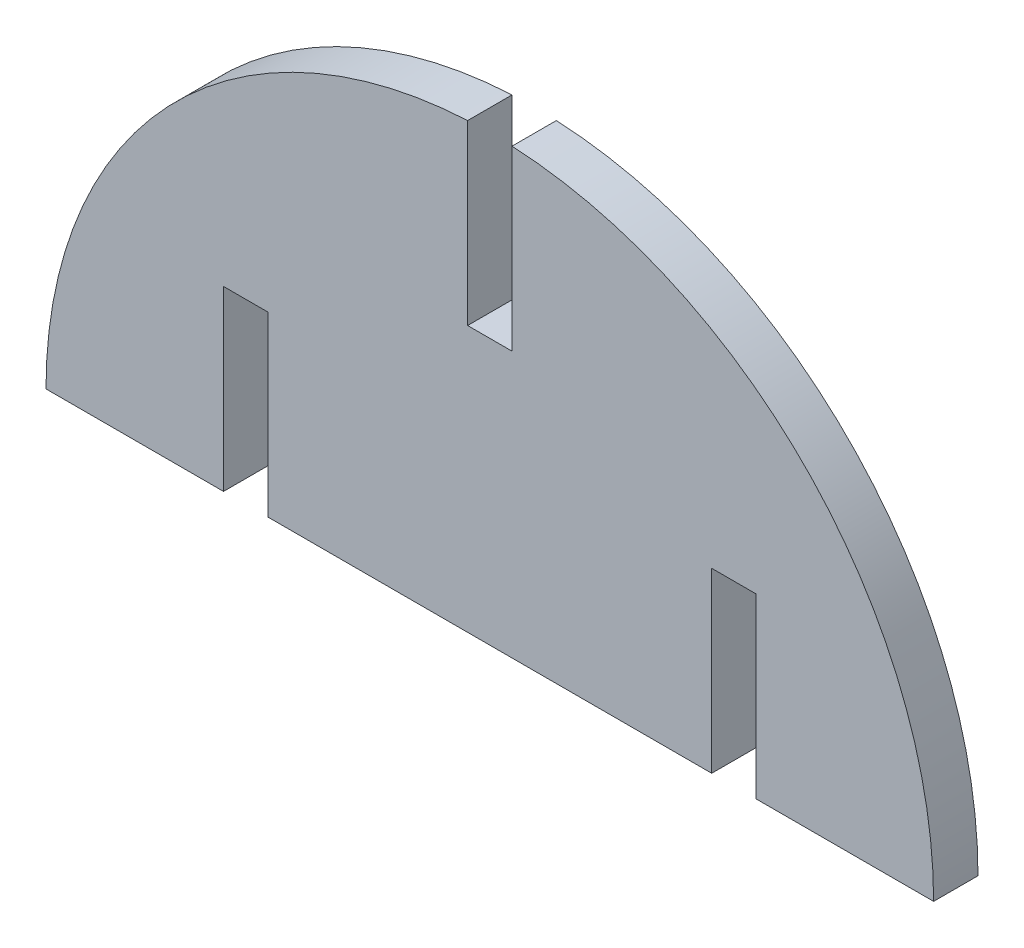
from build123d import *

# Parameters (mm, degrees)
BOSS_EXTRUDE1_DEPTH = 2.5
SKETCH2_W           = 2.5
SKETCH2_H           = 10
CUT_EXTRUDE7_DEPTH  = 2.5
CUT_EXTRUDE8_DEPTH  = 2.5


with BuildPart() as part:
    # Sketch1 → Boss-Extrude1 (new body)
    with BuildSketch(Plane.XY):
        with BuildLine():
            Line((-25, 0), (25, 0))
            ThreePointArc((25, 0), (0, 25), (-25, 0))
        make_face()
    extrude(amount=BOSS_EXTRUDE1_DEPTH)

    # Sketch2 → Cut-Extrude7 (cut)
    with BuildSketch(Plane.XY.offset(2.5)):
        with Locations((-13.75, 5)):
            Rectangle(SKETCH2_W, SKETCH2_H)
        with Locations((13.75, 5)):
            Rectangle(SKETCH2_W, SKETCH2_H)
    extrude(amount=-CUT_EXTRUDE7_DEPTH, mode=Mode.SUBTRACT)

    # Sketch4 → Cut-Extrude8 (cut)
    with BuildSketch(Plane.XY.offset(2.5)):
        Polygon((-1.25, 14.968730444), (1.25, 14.968730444), (1.25, 24.968730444), (0, 25), (-1.25, 24.968730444), align=None)
    extrude(amount=-CUT_EXTRUDE8_DEPTH, mode=Mode.SUBTRACT)


with BuildPart() as body_2:
    # of the pieces the cut leaves, the one that is kept (cut_extrude8_keep)
    add(part.part.solids().sort_by_distance((-25, 0, 0))[0])


solid = body_2.part
